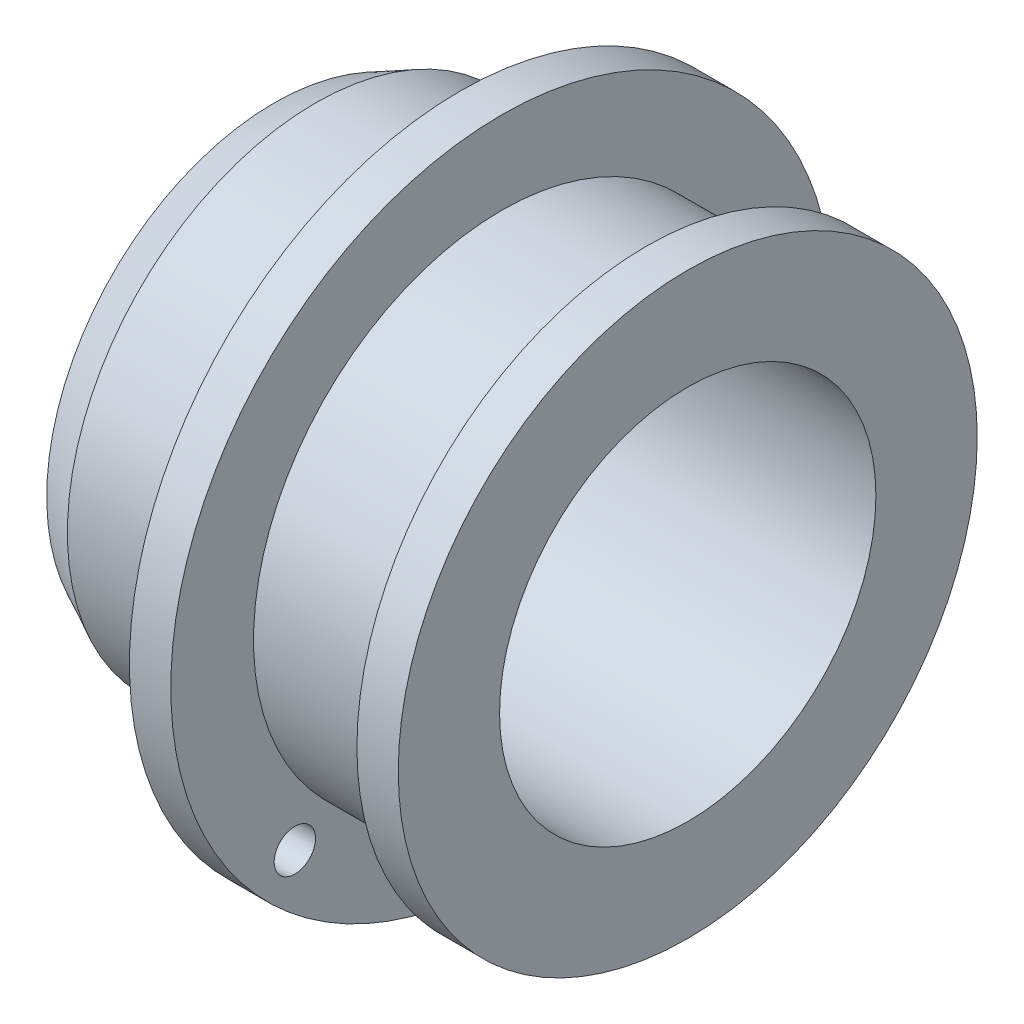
from build123d import *

# Parameters (mm, degrees)
SKETCH6_R          = 6.35
CUT_EXTRUDE1_DEPTH = 76.2
SKETCH7_R          = 57.785
CUT_EXTRUDE2_DEPTH = 139.7


with BuildPart() as part:
    # Sketch4 → Revolve2 (revolve)
    with BuildSketch(Plane.XY):
        Polygon((0, 0), (0, 69.85), (12.7, 76.2), (57.15, 76.2), (57.15, 101.6), (69.85, 101.6), (69.85, 76.2), (114.3, 76.2), (114.3, 88.9), (127, 88.9), (127, 0), align=None)
    revolve(axis=Axis((127, 0, 0), (-1, 0, 0)))

    # Sketch6 → Cut-Extrude1 (cut)
    with BuildSketch(Plane(origin=(69.85, 0, 0), x_dir=(0, 0, -1), z_dir=(1, 0, 0))):
        with Locations(Location((-63.5, -62.217039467, 0), (0, 0, 90))):
            Circle(SKETCH6_R)
        with Locations(Location((63.5, -62.217039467, 0), (0, 0, 90))):
            Circle(SKETCH6_R)
    extrude(amount=-CUT_EXTRUDE1_DEPTH, mode=Mode.SUBTRACT)

    # Sketch7 → Cut-Extrude2 (cut)
    with BuildSketch(Plane.ZY):
        with Locations(Location((0, 0, 0), (0, 0, 270))):
            Circle(SKETCH7_R)
    extrude(amount=-CUT_EXTRUDE2_DEPTH, mode=Mode.SUBTRACT)


solid = part.part
